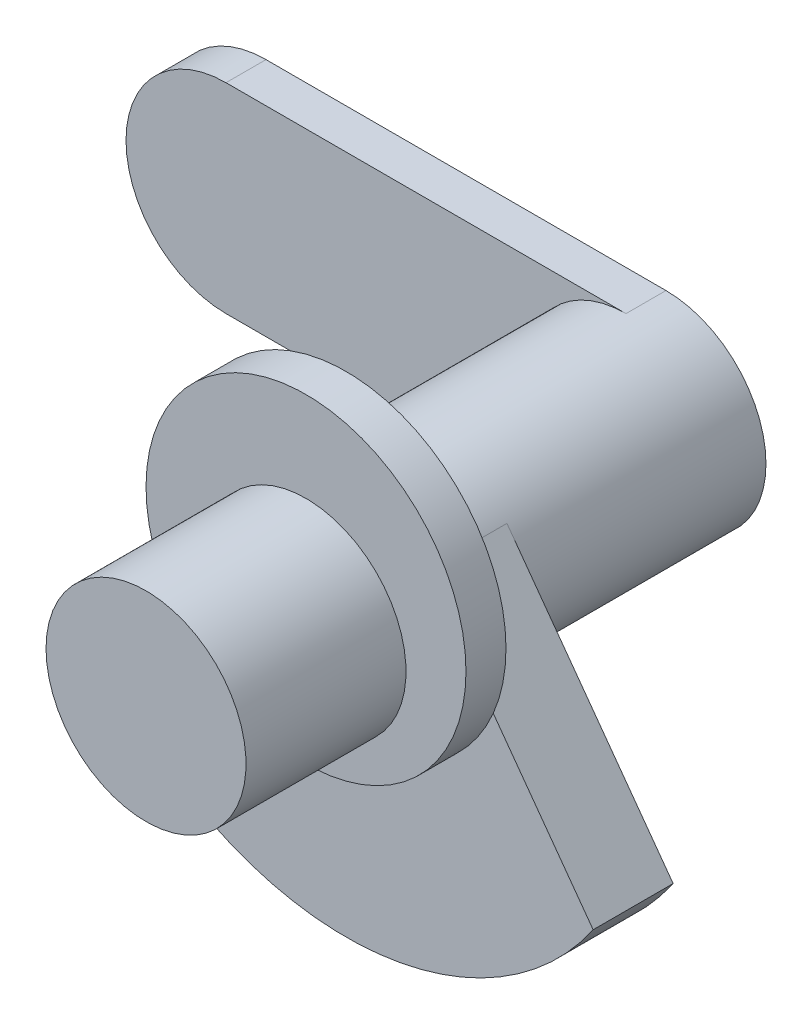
from build123d import *

# Parameters (mm, degrees)
SKETCH1_R           = 63.5
BOSS_EXTRUDE1_DEPTH = 152.4
SKETCH2_R           = 101.6
BOSS_EXTRUDE2_DEPTH = 25.4
BOSS_EXTRUDE3_DEPTH = 50.8
BOSS_EXTRUDE4_DEPTH = 25.4


with BuildPart() as part:
    # Sketch1 → Boss-Extrude1 (new, symmetric)
    with BuildSketch(Plane.XY):
        with Locations(Location((0, 0, 0), (0, 0, 180))):
            Circle(SKETCH1_R)
    extrude(amount=BOSS_EXTRUDE1_DEPTH, both=True)

    # Sketch2 → Boss-Extrude2 (add)
    with BuildSketch(Plane.XY.offset(25.4)):
        with Locations((0, 19.05)):
            Circle(SKETCH2_R)
    extrude(amount=BOSS_EXTRUDE2_DEPTH)

    # Sketch3 → Boss-Extrude3 (add)
    with BuildSketch(Plane.XY.offset(25.4)):
        with BuildLine():
            Line((156.941821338, -107.979232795), (51.372579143, 37.324363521))
            ThreePointArc((51.372579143, 37.324363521), (60.392088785, 19.622579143), (63.5, 0))
            ThreePointArc((63.5, 0), (-19.622579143, -60.392088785), (-51.372579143, 37.324363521))
            Line((-51.372579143, 37.324363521), (-156.941821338, -107.979232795))
            ThreePointArc((-156.941821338, -107.979232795), (0, -190.5), (156.941821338, -107.979232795))
        make_face()
    extrude(amount=-BOSS_EXTRUDE3_DEPTH)

    # Sketch4 → Boss-Extrude4 (add)
    with BuildSketch(Plane(origin=(0, 0, -152.4), x_dir=(-1, 0, 0), z_dir=(0, 0, -1))):
        with BuildLine():
            Line((0, 63.5), (254, 63.5))
            ThreePointArc((254, 63.5), (317.5, 0), (254, -63.5))
            Line((254, -63.5), (0, -63.5))
            ThreePointArc((0, -63.5), (-63.5, 0), (0, 63.5))
        make_face()
    extrude(amount=BOSS_EXTRUDE4_DEPTH)


solid = part.part
